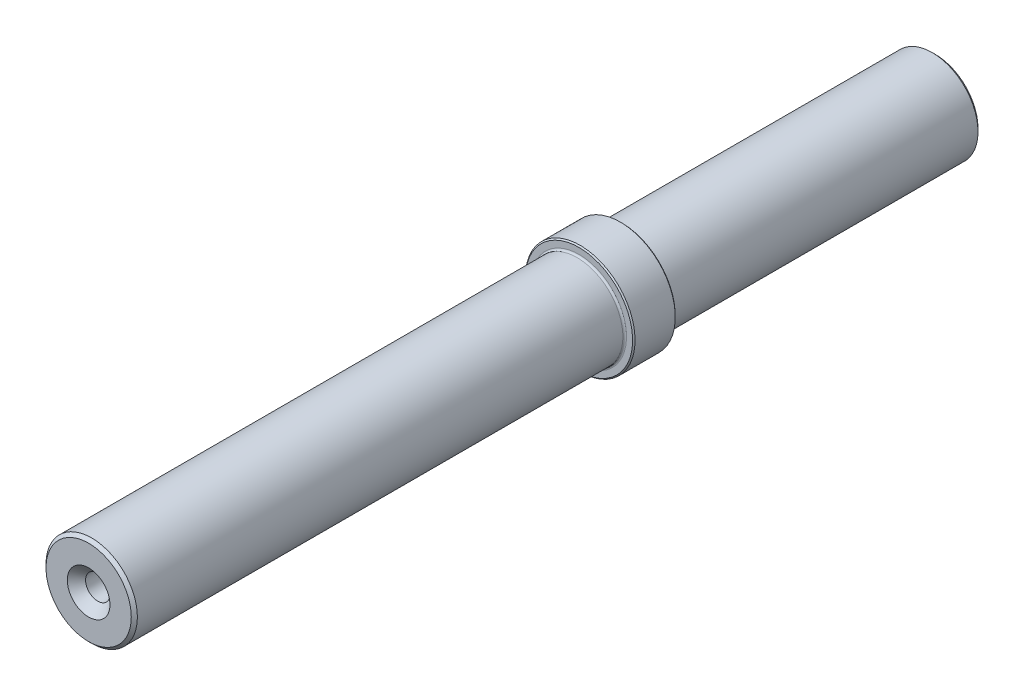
from build123d import *

# Parameters (mm, degrees)
SKETCH_1_R                      = 7.5
EXTRUDE_1_DEPTH                 = 139
SKETCH_3_R                      = 9
EXTRUDE_3_DEPTH                 = 7
HOLE_WIZARD_M5_1_D              = 4.2
HOLE_WIZARD_M5_1_DEPTH          = 12.4
HOLE_WIZARD_M5_1_CSINK_D        = 5.05
HOLE_WIZARD_M5_1_CSINK_ANGLE    = 90
HOLE_WIZARD_M5_1_TIP            = 1.2618073
HOLE_WIZARD_4_0_4_1_D           = 4
HOLE_WIZARD_4_0_4_1_DEPTH       = 15
HOLE_WIZARD_4_0_4_1_CSINK_D     = 7
HOLE_WIZARD_4_0_4_1_CSINK_ANGLE = 90
HOLE_WIZARD_4_0_4_1_TIP         = 1.201721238
CHAMFER_2_SIZE                  = 0.2
FILLET_1_R                      = 0.3
CHAMFER_3_SIZE                  = 0.5


with BuildPart() as part:
    # Sketch 1 → Extrude 1 (new body)
    with BuildSketch(Plane.XY):
        Circle(SKETCH_1_R)
    extrude(amount=EXTRUDE_1_DEPTH)

    # Sketch 3 → Extrude 3 (add)
    with BuildSketch(Plane(origin=(0, 0, 51.5), x_dir=(-1, 0, 0), z_dir=(0, 0, -1))):
        Circle(SKETCH_3_R)
    extrude(amount=-EXTRUDE_3_DEPTH)

    # Hole Wizard M5 _1
    with Locations(Plane(origin=(0, 0, 0), x_dir=(-1, 0, 0), z_dir=(0, 0, -1))):
        with Locations((0, 0)):
            CounterSinkHole(HOLE_WIZARD_M5_1_D / 2, HOLE_WIZARD_M5_1_CSINK_D / 2, depth=HOLE_WIZARD_M5_1_DEPTH, counter_sink_angle=HOLE_WIZARD_M5_1_CSINK_ANGLE)
            with Locations((0, 0, -(HOLE_WIZARD_M5_1_DEPTH + HOLE_WIZARD_M5_1_TIP / 2))):  # 118° drill point
                Cone(0, HOLE_WIZARD_M5_1_D / 2, HOLE_WIZARD_M5_1_TIP, mode=Mode.SUBTRACT)

    # Hole Wizard 4.0 _4_ _1
    with Locations(Plane.XY.offset(139)):
        with Locations((0, 0)):
            CounterSinkHole(HOLE_WIZARD_4_0_4_1_D / 2, HOLE_WIZARD_4_0_4_1_CSINK_D / 2, depth=HOLE_WIZARD_4_0_4_1_DEPTH, counter_sink_angle=HOLE_WIZARD_4_0_4_1_CSINK_ANGLE)
            with Locations((0, 0, -(HOLE_WIZARD_4_0_4_1_DEPTH + HOLE_WIZARD_4_0_4_1_TIP / 2))):  # 118° drill point
                Cone(0, HOLE_WIZARD_4_0_4_1_D / 2, HOLE_WIZARD_4_0_4_1_TIP, mode=Mode.SUBTRACT)

    # Chamfer 2
    chamfer_2_edges = [part.edges().sort_by_distance(p)[0] for p in [
        (9, 0, 58.5),
        (9, 0, 51.5),
    ]]
    chamfer(chamfer_2_edges, length=CHAMFER_2_SIZE)

    # Fillet 1
    fillet_1_edges = [part.edges().sort_by_distance(p)[0] for p in [
        (-7.5, 0, 58.5),
        (-7.5, 0, 51.5),
    ]]
    fillet(fillet_1_edges, radius=FILLET_1_R)

    # Chamfer 3
    chamfer_3_edges = [part.edges().sort_by_distance(p)[0] for p in [
        (-7.5, 0, 0),
        (-7.5, 0, 139),
    ]]
    chamfer(chamfer_3_edges, length=CHAMFER_3_SIZE)


solid = part.part
